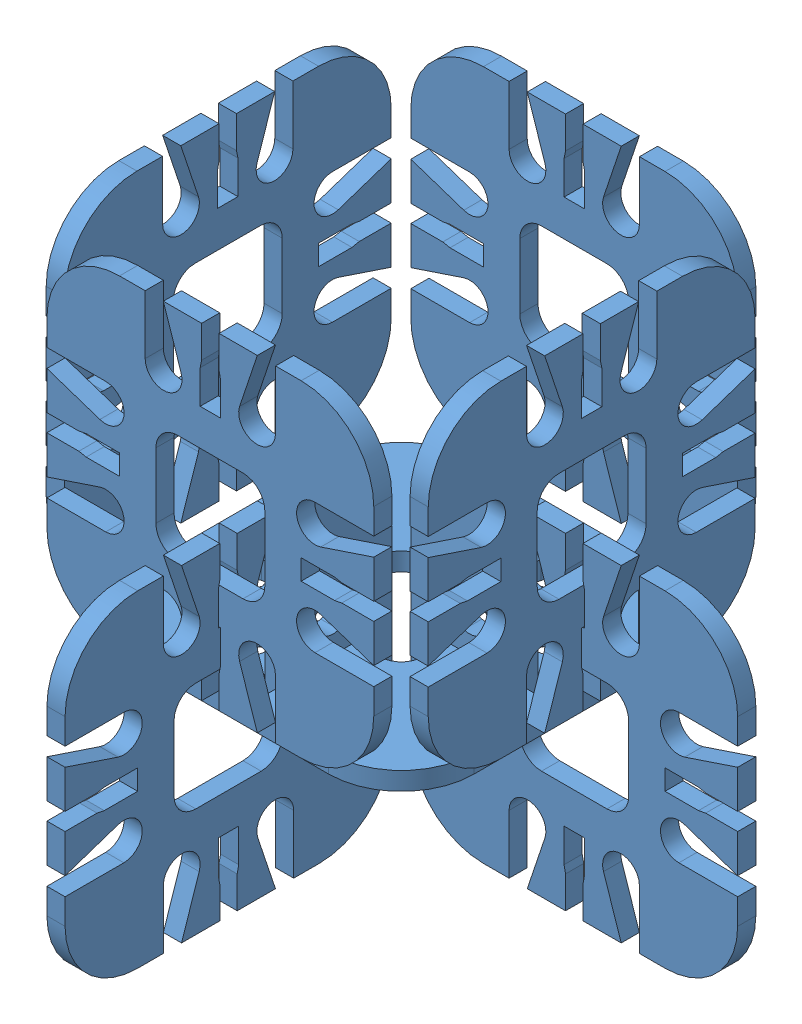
SolidWorks assembly Assem2.sldasm, configuration Default (file format 9000). Lengths in mm.
Overall size (95 70.1 95).
10 component instances, 1 part files, 16 mates.
Components (placement in the parent):
- PlateSubAssly-1: PlateSubAssly.SLDASM [Default] at (23.1752 18.6961 41.0238) size (95 45.1 95)
  - Laser Cut Part-1: Laser Cut Part.SLDPRT [Default] at (12.3206 21.8843 37.1409) size (45 2.5 45)
  - Laser Cut Part-2: Laser Cut Part.SLDPRT [Default] at (-12.6794 23.1843 35.9409) x (1 0 0) z (0 -1 0) size (45 2.5 45)
  - Laser Cut Part-3: Laser Cut Part.SLDPRT [Default] at (13.5206 23.0843 62.1409) x (0 -1 0) z (0 0 -1) size (45 2.5 45)
  - Laser Cut Part-4: Laser Cut Part.SLDPRT [Default] at (37.3206 23.0843 38.3409) x (1 0 0) z (0 1 0) size (45 2.5 45)
  - Laser Cut Part-5: Laser Cut Part.SLDPRT [Default] at (11.0206 23.0843 12.1409) x (0 -1 0) z (0 0 1) size (45 2.5 45)
- Laser Cut Part-1: Laser Cut Part.SLDPRT [Default] at (35.3958 66.7804 101.8646) x (0 -1 0) z (-1 0 0) size (45 2.5 45)
- Laser Cut Part-2: Laser Cut Part.SLDPRT [Default] at (11.6958 66.8804 78.2646) x (0 0 1) z (0 -1 0) size (45 2.5 45)
- Laser Cut Part-3: Laser Cut Part.SLDPRT [Default] at (35.4958 66.7804 51.8646) x (1 0 0) z (0 -1 0) size (45 2.5 45)
- Laser Cut Part-4: Laser Cut Part.SLDPRT [Default] at (61.6958 66.7804 78.1646) x (0 0 -1) z (0 1 0) size (45 2.5 45)
Mates (geometry in assembly coordinates):
- Perpendicular1: perpendicular: plane of PlateSubAssly-1/Laser Cut Part-3 through (36.6958 35.3439 88.7604) normal (1 0 0); plane of Laser Cut Part-1 through (20.9916 60.3439 104.3646) normal (0 0 1)
- Coincident2: coincident anti-aligned: plane of PlateSubAssly-1/Laser Cut Part-3 through (34.1958 54.2804 101.7646) normal (0 1 0); plane of Laser Cut Part-1 through (36.7958 54.2804 104.3646) normal (0 -1 0)
- Coincident3: coincident anti-aligned: plane of PlateSubAssly-1/Laser Cut Part-3 through (34.1958 59.8804 104.3646) normal (0 0 -1); plane of Laser Cut Part-1 through (20.9916 60.3439 104.3646) normal (0 0 1)
- Coincident4: coincident anti-aligned: plane of PlateSubAssly-1/Laser Cut Part-3 through (34.1958 35.3439 88.7604) normal (-1 0 0); plane of Laser Cut Part-1 through (34.1958 48.6804 104.3646) normal (1 0 0)
- Perpendicular2: perpendicular: plane of PlateSubAssly-1/Laser Cut Part-2 through (16.9323 27.4762 76.9646) normal (0 0 -1); plane of Laser Cut Part-2 through (9.1958 52.4762 84.7011) normal (-1 0 0)
- Coincident6: coincident anti-aligned: plane of PlateSubAssly-1/Laser Cut Part-2 through (9.0958 54.3804 79.4646) normal (0 1 0); plane of Laser Cut Part-2 through (9.1958 54.3804 79.6646) normal (0 -1 0)
- Coincident7: coincident anti-aligned: plane of PlateSubAssly-1/Laser Cut Part-2 through (16.9323 27.4762 79.4646) normal (0 0 1); plane of Laser Cut Part-2 through (9.1958 44.3804 79.4646) normal (0 0 -1)
- Coincident8: coincident anti-aligned: plane of PlateSubAssly-1/Laser Cut Part-2 through (11.6958 59.9804 79.4646) normal (-1 0 0); plane of Laser Cut Part-2 through (11.6958 52.4762 84.7011) normal (1 0 0)
- Perpendicular3: perpendicular: plane of PlateSubAssly-1/Laser Cut Part-5 through (36.6958 35.3439 67.5689) normal (1 0 0); plane of Laser Cut Part-3 through (41.9323 52.3762 54.3646) normal (0 0 1)
- Coincident12: coincident: plane of PlateSubAssly-1/Laser Cut Part-5 through (36.6958 35.3439 67.5689) normal (1 0 0); plane of Laser Cut Part-3 through (36.6958 44.2804 54.3646) normal (-1 0 0)
- Coincident14: coincident: plane of PlateSubAssly-1/Laser Cut Part-5 through (36.6958 64.2804 54.3646) normal (0 0 -1); plane of Laser Cut Part-3 through (41.9323 52.3762 54.3646) normal (0 0 1)
- Coincident15: coincident anti-aligned: plane of PlateSubAssly-1/Laser Cut Part-5 through (36.6958 54.2804 54.5646) normal (0 1 0); plane of Laser Cut Part-3 through (36.8958 54.2804 54.3646) normal (0 -1 0)
- Perpendicular4: perpendicular: plane of PlateSubAssly-1/Laser Cut Part-4 through (66.9323 56.1846 76.8646) normal (0 0 -1); plane of Laser Cut Part-4 through (59.1958 81.1846 71.7281) normal (-1 0 0)
- Coincident17: coincident: plane of PlateSubAssly-1/Laser Cut Part-4 through (61.8958 54.2804 76.8646) normal (0 1 0); plane of Laser Cut Part-4 through (59.1958 54.2804 79.5646) normal (0 -1 0)
- Coincident18: coincident: plane of PlateSubAssly-1/Laser Cut Part-4 through (66.9323 56.1846 79.3646) normal (0 0 1); plane of Laser Cut Part-4 through (59.1958 44.2804 79.3646) normal (0 0 -1)
- Coincident19: coincident anti-aligned: plane of PlateSubAssly-1/Laser Cut Part-4 through (61.6958 64.2804 76.8646) normal (-1 0 0); plane of Laser Cut Part-4 through (61.6958 81.1846 71.7281) normal (1 0 0)
